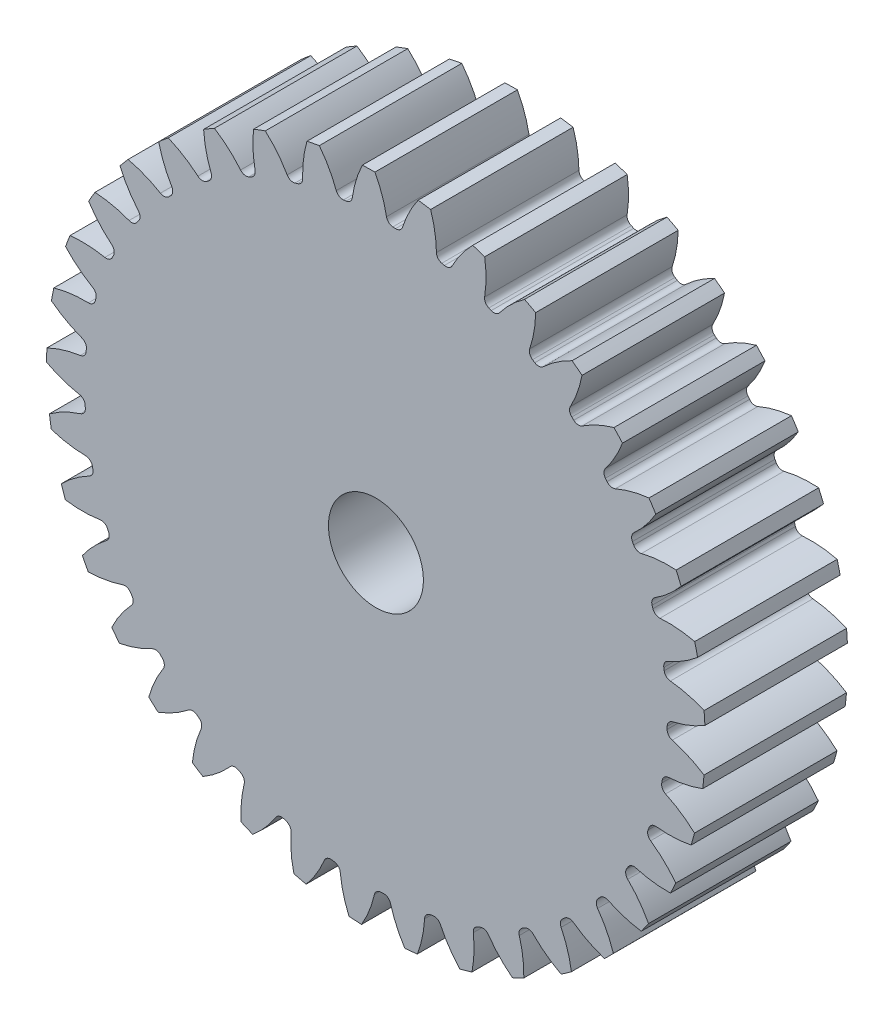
from build123d import *

# Parameters (mm, degrees)
SKETCH3_R         = 220.133333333
GEARBODY_DEPTH    = 95.25
TOOTHCUT_DEPTH    = 326.560948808
CIRPATTERN1_COUNT = 37
BOREDIA_R         = 31.75
BORE_DEPTH        = 12700


with BuildPart() as part:
    # Sketch3 → gearBody (new body)
    with BuildSketch(Plane.XY):
        Circle(SKETCH3_R)
    extrude(amount=GEARBODY_DEPTH)

    # Sketch2 → toothCut (cut, through all)
    with BuildSketch(Plane.XY):
        with BuildLine():
            ThreePointArc((194.672667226, -4.860426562), (194.693056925, -3.96039094), (194.709285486, -3.060270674))
            ThreePointArc((194.709285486, -3.060270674), (195.73134469, -0.242612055), (198.273512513, 1.345212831))
            ThreePointArc((198.273512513, 1.345212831), (209.547605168, 4.884621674), (220.133333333, 10.135806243))
            ThreePointArc((220.133333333, 10.135806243), (220.320977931, -4.48170684), (219.539043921, -19.07949703))
            ThreePointArc((219.539043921, -19.07949703), (209.175620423, -13.40217076), (198.054789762, -9.407210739))
            ThreePointArc((198.054789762, -9.407210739), (195.579296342, -7.717318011), (194.672667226, -4.860426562))
        make_face()
    toothcut = extrude(amount=TOOTHCUT_DEPTH, mode=Mode.SUBTRACT)

    # CirPattern1: toothCut ×37 about axis
    cirpattern1_axis = Axis((0, 0, 0), (0, 0, 1))
    for i in range(1, CIRPATTERN1_COUNT):
        add(toothcut.rotate(cirpattern1_axis, i * 360 / CIRPATTERN1_COUNT), mode=Mode.SUBTRACT)

    # boreDia → bore (cut, symmetric)
    with BuildSketch(Plane.XY):
        Circle(BOREDIA_R)
    extrude(amount=BORE_DEPTH, both=True, mode=Mode.SUBTRACT)


solid = part.part
